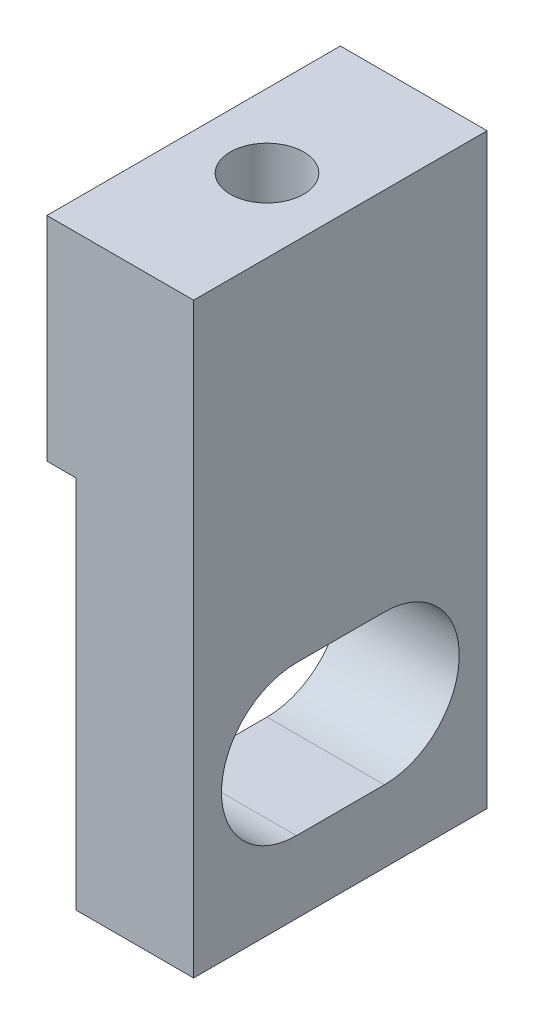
ISO-10303-21;
HEADER;
FILE_DESCRIPTION(('STEP AP214'),'2;1');
FILE_NAME('part.step','',(''),(''),'','','');
FILE_SCHEMA(('AUTOMOTIVE_DESIGN { 1 0 10303 214 1 1 1 1 }'));
ENDSEC;
DATA;
#1=APPLICATION_CONTEXT('core data for automotive mechanical design processes');
#2=APPLICATION_PROTOCOL_DEFINITION('international standard','automotive_design',2000,#1);
#3=PRODUCT_CONTEXT('',#1,'mechanical');
#4=PRODUCT('Part','Part','',(#3));
#5=PRODUCT_RELATED_PRODUCT_CATEGORY('part','',(#4));
#6=PRODUCT_DEFINITION_FORMATION('','',#4);
#7=PRODUCT_DEFINITION_CONTEXT('part definition',#1,'design');
#8=PRODUCT_DEFINITION('design','',#6,#7);
#9=PRODUCT_DEFINITION_SHAPE('','',#8);
#10=(LENGTH_UNIT() NAMED_UNIT(*) SI_UNIT(.MILLI.,.METRE.));
#11=(NAMED_UNIT(*) PLANE_ANGLE_UNIT() SI_UNIT($,.RADIAN.));
#12=(NAMED_UNIT(*) SI_UNIT($,.STERADIAN.) SOLID_ANGLE_UNIT());
#13=UNCERTAINTY_MEASURE_WITH_UNIT(LENGTH_MEASURE(1.E-05),#10,'distance_accuracy_value','');
#14=(GEOMETRIC_REPRESENTATION_CONTEXT(3) GLOBAL_UNCERTAINTY_ASSIGNED_CONTEXT((#13)) GLOBAL_UNIT_ASSIGNED_CONTEXT((#10,
#11,#12)) REPRESENTATION_CONTEXT('',''));
#15=CARTESIAN_POINT('',(0.,0.,0.));
#16=DIRECTION('',(0.,0.,1.));
#17=DIRECTION('',(1.,0.,0.));
#18=AXIS2_PLACEMENT_3D('',#15,#16,#17);
#19=CARTESIAN_POINT('',(0.,-14.5,10.));
#20=DIRECTION('',(1.00000000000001,0.,0.));
#21=DIRECTION('',(0.,0.,-1.00000000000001));
#22=AXIS2_PLACEMENT_3D('',#19,#20,#21);
#23=PLANE('',#22);
#24=DIRECTION('',(0.,-1.,0.));
#25=VECTOR('',#24,1.);
#26=CARTESIAN_POINT('',(0.,-14.5,-10.));
#27=LINE('',#26,#25);
#28=CARTESIAN_POINT('',(0.,0.,-10.));
#29=VERTEX_POINT('',#28);
#30=CARTESIAN_POINT('',(0.,-14.5,-10.));
#31=VERTEX_POINT('',#30);
#32=EDGE_CURVE('E177',#29,#31,#27,.T.);
#33=ORIENTED_EDGE('',*,*,#32,.T.);
#34=DIRECTION('',(0.,0.,-1.00000000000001));
#35=VECTOR('',#34,1.);
#36=CARTESIAN_POINT('',(0.,-14.5,10.));
#37=LINE('',#36,#35);
#38=CARTESIAN_POINT('',(0.,-14.5,10.));
#39=VERTEX_POINT('',#38);
#40=EDGE_CURVE('E11',#39,#31,#37,.T.);
#41=ORIENTED_EDGE('',*,*,#40,.F.);
#42=DIRECTION('',(0.,-1.,0.));
#43=VECTOR('',#42,1.);
#44=CARTESIAN_POINT('',(0.,-14.5,10.));
#45=LINE('',#44,#43);
#46=CARTESIAN_POINT('',(0.,0.,10.));
#47=VERTEX_POINT('',#46);
#48=EDGE_CURVE('E196',#47,#39,#45,.T.);
#49=ORIENTED_EDGE('',*,*,#48,.F.);
#50=DIRECTION('',(0.,0.,-1.00000000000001));
#51=VECTOR('',#50,1.);
#52=CARTESIAN_POINT('',(0.,0.,10.));
#53=LINE('',#52,#51);
#54=EDGE_CURVE('E215',#47,#29,#53,.T.);
#55=ORIENTED_EDGE('',*,*,#54,.T.);
#56=EDGE_LOOP('',(#33,#41,#49,#55));
#57=FACE_BOUND('',#56,.T.);
#58=ADVANCED_FACE('F42',(#57),#23,.F.);
#59=CARTESIAN_POINT('',(2.,-14.5,10.));
#60=DIRECTION('',(0.,1.,0.));
#61=DIRECTION('',(0.,0.,1.00000000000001));
#62=AXIS2_PLACEMENT_3D('',#59,#60,#61);
#63=PLANE('',#62);
#64=DIRECTION('',(1.00000000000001,0.,0.));
#65=VECTOR('',#64,1.);
#66=CARTESIAN_POINT('',(2.00000000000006,-14.5,-10.));
#67=LINE('',#66,#65);
#68=CARTESIAN_POINT('',(2.00000000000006,-14.5,-10.));
#69=VERTEX_POINT('',#68);
#70=EDGE_CURVE('E181',#31,#69,#67,.T.);
#71=ORIENTED_EDGE('',*,*,#70,.T.);
#72=DIRECTION('',(0.,0.,-1.00000000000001));
#73=VECTOR('',#72,1.);
#74=CARTESIAN_POINT('',(2.,-14.5,10.));
#75=LINE('',#74,#73);
#76=CARTESIAN_POINT('',(2.,-14.5,10.));
#77=VERTEX_POINT('',#76);
#78=EDGE_CURVE('E50',#77,#69,#75,.T.);
#79=ORIENTED_EDGE('',*,*,#78,.F.);
#80=DIRECTION('',(1.00000000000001,0.,0.));
#81=VECTOR('',#80,1.);
#82=CARTESIAN_POINT('',(2.,-14.5,10.));
#83=LINE('',#82,#81);
#84=EDGE_CURVE('E200',#39,#77,#83,.T.);
#85=ORIENTED_EDGE('',*,*,#84,.F.);
#86=ORIENTED_EDGE('',*,*,#40,.T.);
#87=EDGE_LOOP('',(#71,#79,#85,#86));
#88=FACE_BOUND('',#87,.T.);
#89=ADVANCED_FACE('F258',(#88),#63,.F.);
#90=CARTESIAN_POINT('',(2.00000000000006,-40.,10.000000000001));
#91=DIRECTION('',(1.00000000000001,0.,0.));
#92=DIRECTION('',(0.,0.,-1.00000000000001));
#93=AXIS2_PLACEMENT_3D('',#90,#91,#92);
#94=PLANE('',#93);
#95=DIRECTION('',(0.,0.,1.00000000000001));
#96=VECTOR('',#95,1.);
#97=CARTESIAN_POINT('',(2.00000000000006,-35.1,3.00000000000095));
#98=LINE('',#97,#96);
#99=CARTESIAN_POINT('',(2.00000000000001,-35.1,-2.99999999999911));
#100=VERTEX_POINT('',#99);
#101=CARTESIAN_POINT('',(2.00000000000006,-35.1,3.00000000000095));
#102=VERTEX_POINT('',#101);
#103=EDGE_CURVE('E140',#100,#102,#98,.T.);
#104=ORIENTED_EDGE('',*,*,#103,.F.);
#105=CARTESIAN_POINT('',(2.00000000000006,-30.,-3.));
#106=DIRECTION('',(1.00000000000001,0.,0.));
#107=DIRECTION('',(0.,0.,-1.00000000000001));
#108=AXIS2_PLACEMENT_3D('',#105,#106,#107);
#109=CIRCLE('',#108,5.1);
#110=CARTESIAN_POINT('',(2.00000000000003,-24.9,-3.00000000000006));
#111=VERTEX_POINT('',#110);
#112=EDGE_CURVE('E144',#111,#100,#109,.F.);
#113=ORIENTED_EDGE('',*,*,#112,.F.);
#114=DIRECTION('',(0.,0.,-1.00000000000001));
#115=VECTOR('',#114,1.);
#116=CARTESIAN_POINT('',(2.00000000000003,-24.9,-3.00000000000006));
#117=LINE('',#116,#115);
#118=CARTESIAN_POINT('',(2.00000000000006,-24.9,3.));
#119=VERTEX_POINT('',#118);
#120=EDGE_CURVE('E166',#119,#111,#117,.T.);
#121=ORIENTED_EDGE('',*,*,#120,.F.);
#122=CARTESIAN_POINT('',(2.00000000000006,-30.,3.));
#123=DIRECTION('',(1.00000000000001,0.,0.));
#124=DIRECTION('',(0.,0.,-1.00000000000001));
#125=AXIS2_PLACEMENT_3D('',#122,#123,#124);
#126=CIRCLE('',#125,5.1);
#127=EDGE_CURVE('E57',#102,#119,#126,.F.);
#128=ORIENTED_EDGE('',*,*,#127,.F.);
#129=EDGE_LOOP('',(#104,#113,#121,#128));
#130=FACE_BOUND('',#129,.T.);
#131=DIRECTION('',(0.,-1.,0.));
#132=VECTOR('',#131,1.);
#133=CARTESIAN_POINT('',(2.00000000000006,-40.,-9.99999999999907));
#134=LINE('',#133,#132);
#135=CARTESIAN_POINT('',(2.00000000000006,-40.,-9.99999999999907));
#136=VERTEX_POINT('',#135);
#137=EDGE_CURVE('E184',#69,#136,#134,.T.);
#138=ORIENTED_EDGE('',*,*,#137,.T.);
#139=DIRECTION('',(0.,0.,-1.00000000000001));
#140=VECTOR('',#139,1.);
#141=CARTESIAN_POINT('',(2.00000000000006,-40.,10.000000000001));
#142=LINE('',#141,#140);
#143=CARTESIAN_POINT('',(2.00000000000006,-40.,10.000000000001));
#144=VERTEX_POINT('',#143);
#145=EDGE_CURVE('E226',#144,#136,#142,.T.);
#146=ORIENTED_EDGE('',*,*,#145,.F.);
#147=DIRECTION('',(0.,-1.,0.));
#148=VECTOR('',#147,1.);
#149=CARTESIAN_POINT('',(2.00000000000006,-40.,10.000000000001));
#150=LINE('',#149,#148);
#151=EDGE_CURVE('E203',#77,#144,#150,.T.);
#152=ORIENTED_EDGE('',*,*,#151,.F.);
#153=ORIENTED_EDGE('',*,*,#78,.T.);
#154=EDGE_LOOP('',(#138,#146,#152,#153));
#155=FACE_BOUND('',#154,.T.);
#156=ADVANCED_FACE('F235',(#130,#155),#94,.F.);
#157=CARTESIAN_POINT('',(10.0000000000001,-39.9999999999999,10.000000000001));
#158=DIRECTION('',(0.,1.,0.));
#159=DIRECTION('',(0.,0.,1.00000000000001));
#160=AXIS2_PLACEMENT_3D('',#157,#158,#159);
#161=PLANE('',#160);
#162=DIRECTION('',(1.00000000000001,0.,0.));
#163=VECTOR('',#162,1.);
#164=CARTESIAN_POINT('',(10.0000000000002,-39.9999999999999,-9.99999999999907));
#165=LINE('',#164,#163);
#166=CARTESIAN_POINT('',(10.0000000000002,-39.9999999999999,-9.99999999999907));
#167=VERTEX_POINT('',#166);
#168=EDGE_CURVE('E187',#136,#167,#165,.T.);
#169=ORIENTED_EDGE('',*,*,#168,.T.);
#170=DIRECTION('',(0.,0.,-1.00000000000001));
#171=VECTOR('',#170,1.);
#172=CARTESIAN_POINT('',(10.0000000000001,-39.9999999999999,10.000000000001));
#173=LINE('',#172,#171);
#174=CARTESIAN_POINT('',(10.0000000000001,-39.9999999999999,10.000000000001));
#175=VERTEX_POINT('',#174);
#176=EDGE_CURVE('E222',#175,#167,#173,.T.);
#177=ORIENTED_EDGE('',*,*,#176,.F.);
#178=DIRECTION('',(1.00000000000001,0.,0.));
#179=VECTOR('',#178,1.);
#180=CARTESIAN_POINT('',(10.0000000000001,-39.9999999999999,10.000000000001));
#181=LINE('',#180,#179);
#182=EDGE_CURVE('E206',#144,#175,#181,.T.);
#183=ORIENTED_EDGE('',*,*,#182,.F.);
#184=ORIENTED_EDGE('',*,*,#145,.T.);
#185=EDGE_LOOP('',(#169,#177,#183,#184));
#186=FACE_BOUND('',#185,.T.);
#187=ADVANCED_FACE('F246',(#186),#161,.F.);
#188=CARTESIAN_POINT('',(10.0000000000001,0.,10.));
#189=DIRECTION('',(-1.00000000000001,0.,0.));
#190=DIRECTION('',(0.,-1.,0.));
#191=AXIS2_PLACEMENT_3D('',#188,#189,#190);
#192=PLANE('',#191);
#193=DIRECTION('',(0.,0.,1.00000000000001));
#194=VECTOR('',#193,1.);
#195=CARTESIAN_POINT('',(9.9999999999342,-24.8999999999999,-3.00000000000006));
#196=LINE('',#195,#194);
#197=CARTESIAN_POINT('',(10.0000000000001,-24.8999999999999,-3.00000000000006));
#198=VERTEX_POINT('',#197);
#199=CARTESIAN_POINT('',(9.99999999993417,-24.8999999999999,3.));
#200=VERTEX_POINT('',#199);
#201=EDGE_CURVE('E150',#198,#200,#196,.T.);
#202=ORIENTED_EDGE('',*,*,#201,.F.);
#203=CARTESIAN_POINT('',(9.99999999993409,-29.9999999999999,-2.99999999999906));
#204=DIRECTION('',(1.00000000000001,0.,0.));
#205=DIRECTION('',(0.,1.,0.));
#206=AXIS2_PLACEMENT_3D('',#203,#204,#205);
#207=CIRCLE('',#206,5.1);
#208=CARTESIAN_POINT('',(9.99999999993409,-35.0999999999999,-2.99999999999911));
#209=VERTEX_POINT('',#208);
#210=EDGE_CURVE('E65',#209,#198,#207,.T.);
#211=ORIENTED_EDGE('',*,*,#210,.F.);
#212=DIRECTION('',(0.,0.,-1.00000000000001));
#213=VECTOR('',#212,1.);
#214=CARTESIAN_POINT('',(9.99999999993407,-35.0999999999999,3.00000000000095));
#215=LINE('',#214,#213);
#216=CARTESIAN_POINT('',(9.99999999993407,-35.0999999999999,3.00000000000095));
#217=VERTEX_POINT('',#216);
#218=EDGE_CURVE('E158',#217,#209,#215,.T.);
#219=ORIENTED_EDGE('',*,*,#218,.F.);
#220=CARTESIAN_POINT('',(9.99999999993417,-29.9999999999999,3.00000000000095));
#221=DIRECTION('',(1.00000000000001,0.,0.));
#222=DIRECTION('',(0.,1.,0.));
#223=AXIS2_PLACEMENT_3D('',#220,#221,#222);
#224=CIRCLE('',#223,5.1);
#225=EDGE_CURVE('E154',#200,#217,#224,.T.);
#226=ORIENTED_EDGE('',*,*,#225,.F.);
#227=EDGE_LOOP('',(#202,#211,#219,#226));
#228=FACE_BOUND('',#227,.T.);
#229=DIRECTION('',(0.,1.,0.));
#230=VECTOR('',#229,1.);
#231=CARTESIAN_POINT('',(10.0000000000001,0.,-10.));
#232=LINE('',#231,#230);
#233=CARTESIAN_POINT('',(10.0000000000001,0.,-10.));
#234=VERTEX_POINT('',#233);
#235=EDGE_CURVE('E190',#167,#234,#232,.T.);
#236=ORIENTED_EDGE('',*,*,#235,.T.);
#237=DIRECTION('',(0.,0.,-1.00000000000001));
#238=VECTOR('',#237,1.);
#239=CARTESIAN_POINT('',(10.0000000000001,0.,10.));
#240=LINE('',#239,#238);
#241=CARTESIAN_POINT('',(10.0000000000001,0.,10.));
#242=VERTEX_POINT('',#241);
#243=EDGE_CURVE('E219',#242,#234,#240,.T.);
#244=ORIENTED_EDGE('',*,*,#243,.F.);
#245=DIRECTION('',(0.,1.,0.));
#246=VECTOR('',#245,1.);
#247=CARTESIAN_POINT('',(10.0000000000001,0.,10.));
#248=LINE('',#247,#246);
#249=EDGE_CURVE('E209',#175,#242,#248,.T.);
#250=ORIENTED_EDGE('',*,*,#249,.F.);
#251=ORIENTED_EDGE('',*,*,#176,.T.);
#252=EDGE_LOOP('',(#236,#244,#250,#251));
#253=FACE_BOUND('',#252,.T.);
#254=ADVANCED_FACE('F250',(#228,#253),#192,.F.);
#255=CARTESIAN_POINT('',(0.,0.,10.));
#256=DIRECTION('',(0.,-1.,0.));
#257=DIRECTION('',(0.,0.,-1.00000000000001));
#258=AXIS2_PLACEMENT_3D('',#255,#256,#257);
#259=PLANE('',#258);
#260=CARTESIAN_POINT('',(5.00000000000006,0.,0.));
#261=DIRECTION('',(0.,1.,0.));
#262=DIRECTION('',(0.,0.,1.00000000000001));
#263=AXIS2_PLACEMENT_3D('',#260,#261,#262);
#264=CIRCLE('',#263,2.49999999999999);
#265=CARTESIAN_POINT('',(5.00000000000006,0.,2.50000000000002));
#266=VERTEX_POINT('',#265);
#267=EDGE_CURVE('E130',#266,#266,#264,.T.);
#268=ORIENTED_EDGE('',*,*,#267,.F.);
#269=EDGE_LOOP('',(#268));
#270=FACE_BOUND('',#269,.T.);
#271=DIRECTION('',(-1.00000000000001,0.,0.));
#272=VECTOR('',#271,1.);
#273=CARTESIAN_POINT('',(0.,0.,-10.));
#274=LINE('',#273,#272);
#275=EDGE_CURVE('E193',#234,#29,#274,.T.);
#276=ORIENTED_EDGE('',*,*,#275,.T.);
#277=ORIENTED_EDGE('',*,*,#54,.F.);
#278=DIRECTION('',(-1.00000000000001,0.,0.));
#279=VECTOR('',#278,1.);
#280=CARTESIAN_POINT('',(0.,0.,10.));
#281=LINE('',#280,#279);
#282=EDGE_CURVE('E212',#242,#47,#281,.T.);
#283=ORIENTED_EDGE('',*,*,#282,.F.);
#284=ORIENTED_EDGE('',*,*,#243,.T.);
#285=EDGE_LOOP('',(#276,#277,#283,#284));
#286=FACE_BOUND('',#285,.T.);
#287=ADVANCED_FACE('F261',(#270,#286),#259,.F.);
#288=CARTESIAN_POINT('',(0.,0.,10.));
#289=DIRECTION('',(0.,0.,-1.00000000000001));
#290=DIRECTION('',(-1.00000000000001,0.,0.));
#291=AXIS2_PLACEMENT_3D('',#288,#289,#290);
#292=PLANE('',#291);
#293=ORIENTED_EDGE('',*,*,#48,.T.);
#294=ORIENTED_EDGE('',*,*,#84,.T.);
#295=ORIENTED_EDGE('',*,*,#151,.T.);
#296=ORIENTED_EDGE('',*,*,#182,.T.);
#297=ORIENTED_EDGE('',*,*,#249,.T.);
#298=ORIENTED_EDGE('',*,*,#282,.T.);
#299=EDGE_LOOP('',(#293,#294,#295,#296,#297,#298));
#300=FACE_BOUND('',#299,.T.);
#301=ADVANCED_FACE('F254',(#300),#292,.F.);
#302=CARTESIAN_POINT('',(0.,0.,-10.));
#303=DIRECTION('',(0.,0.,-1.00000000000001));
#304=DIRECTION('',(-1.00000000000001,0.,0.));
#305=AXIS2_PLACEMENT_3D('',#302,#303,#304);
#306=PLANE('',#305);
#307=ORIENTED_EDGE('',*,*,#32,.F.);
#308=ORIENTED_EDGE('',*,*,#275,.F.);
#309=ORIENTED_EDGE('',*,*,#235,.F.);
#310=ORIENTED_EDGE('',*,*,#168,.F.);
#311=ORIENTED_EDGE('',*,*,#137,.F.);
#312=ORIENTED_EDGE('',*,*,#70,.F.);
#313=EDGE_LOOP('',(#307,#308,#309,#310,#311,#312));
#314=FACE_BOUND('',#313,.T.);
#315=ADVANCED_FACE('F241',(#314),#306,.T.);
#316=CARTESIAN_POINT('',(-0.00099999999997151,-30.,-3.));
#317=DIRECTION('',(1.00000000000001,0.,0.));
#318=DIRECTION('',(0.,1.,0.));
#319=AXIS2_PLACEMENT_3D('',#316,#317,#318);
#320=CYLINDRICAL_SURFACE('',#319,5.1);
#321=ORIENTED_EDGE('',*,*,#112,.T.);
#322=DIRECTION('',(1.00000000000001,0.,0.));
#323=VECTOR('',#322,1.);
#324=CARTESIAN_POINT('',(-0.00100000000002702,-35.1,-2.99999999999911));
#325=LINE('',#324,#323);
#326=EDGE_CURVE('E163',#100,#209,#325,.T.);
#327=ORIENTED_EDGE('',*,*,#326,.T.);
#328=ORIENTED_EDGE('',*,*,#210,.T.);
#329=DIRECTION('',(1.00000000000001,0.,0.));
#330=VECTOR('',#329,1.);
#331=CARTESIAN_POINT('',(-0.00100000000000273,-24.9,-3.00000000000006));
#332=LINE('',#331,#330);
#333=EDGE_CURVE('E162',#111,#198,#332,.T.);
#334=ORIENTED_EDGE('',*,*,#333,.F.);
#335=EDGE_LOOP('',(#321,#327,#328,#334));
#336=FACE_BOUND('',#335,.T.);
#337=ADVANCED_FACE('F308',(#336),#320,.F.);
#338=CARTESIAN_POINT('',(-0.001000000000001,-35.1,3.00000000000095));
#339=DIRECTION('',(0.,-1.,0.));
#340=DIRECTION('',(1.00000000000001,0.,0.));
#341=AXIS2_PLACEMENT_3D('',#338,#339,#340);
#342=PLANE('',#341);
#343=ORIENTED_EDGE('',*,*,#103,.T.);
#344=DIRECTION('',(1.00000000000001,0.,0.));
#345=VECTOR('',#344,1.);
#346=CARTESIAN_POINT('',(-0.001000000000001,-35.1,3.00000000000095));
#347=LINE('',#346,#345);
#348=EDGE_CURVE('E167',#102,#217,#347,.T.);
#349=ORIENTED_EDGE('',*,*,#348,.T.);
#350=ORIENTED_EDGE('',*,*,#218,.T.);
#351=ORIENTED_EDGE('',*,*,#326,.F.);
#352=EDGE_LOOP('',(#343,#349,#350,#351));
#353=FACE_BOUND('',#352,.T.);
#354=ADVANCED_FACE('F316',(#353),#342,.F.);
#355=CARTESIAN_POINT('',(-0.001000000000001,-30.,3.));
#356=DIRECTION('',(1.00000000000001,0.,0.));
#357=DIRECTION('',(0.,1.,0.));
#358=AXIS2_PLACEMENT_3D('',#355,#356,#357);
#359=CYLINDRICAL_SURFACE('',#358,5.1);
#360=ORIENTED_EDGE('',*,*,#127,.T.);
#361=DIRECTION('',(1.00000000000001,0.,0.));
#362=VECTOR('',#361,1.);
#363=CARTESIAN_POINT('',(-0.00100000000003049,-24.9,3.));
#364=LINE('',#363,#362);
#365=EDGE_CURVE('E170',#119,#200,#364,.T.);
#366=ORIENTED_EDGE('',*,*,#365,.T.);
#367=ORIENTED_EDGE('',*,*,#225,.T.);
#368=ORIENTED_EDGE('',*,*,#348,.F.);
#369=EDGE_LOOP('',(#360,#366,#367,#368));
#370=FACE_BOUND('',#369,.T.);
#371=ADVANCED_FACE('F324',(#370),#359,.F.);
#372=CARTESIAN_POINT('',(-0.00100000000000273,-24.9,-3.00000000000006));
#373=DIRECTION('',(0.,1.,0.));
#374=DIRECTION('',(-1.00000000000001,0.,0.));
#375=AXIS2_PLACEMENT_3D('',#372,#373,#374);
#376=PLANE('',#375);
#377=ORIENTED_EDGE('',*,*,#120,.T.);
#378=ORIENTED_EDGE('',*,*,#333,.T.);
#379=ORIENTED_EDGE('',*,*,#201,.T.);
#380=ORIENTED_EDGE('',*,*,#365,.F.);
#381=EDGE_LOOP('',(#377,#378,#379,#380));
#382=FACE_BOUND('',#381,.T.);
#383=ADVANCED_FACE('F333',(#382),#376,.F.);
#384=CARTESIAN_POINT('',(5.00000000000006,0.,0.));
#385=DIRECTION('',(0.,1.,0.));
#386=DIRECTION('',(0.,0.,1.00000000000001));
#387=AXIS2_PLACEMENT_3D('',#384,#385,#386);
#388=CYLINDRICAL_SURFACE('',#387,2.49999999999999);
#389=CARTESIAN_POINT('',(5.00000000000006,-16.,0.));
#390=DIRECTION('',(0.,1.,0.));
#391=DIRECTION('',(0.,0.,1.00000000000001));
#392=AXIS2_PLACEMENT_3D('',#389,#390,#391);
#393=CIRCLE('',#392,2.49999999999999);
#394=CARTESIAN_POINT('',(5.00000000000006,-16.,2.50000000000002));
#395=VERTEX_POINT('',#394);
#396=EDGE_CURVE('E127',#395,#395,#393,.T.);
#397=ORIENTED_EDGE('',*,*,#396,.F.);
#398=EDGE_LOOP('',(#397));
#399=FACE_BOUND('',#398,.T.);
#400=ORIENTED_EDGE('',*,*,#267,.T.);
#401=EDGE_LOOP('',(#400));
#402=FACE_BOUND('',#401,.T.);
#403=ADVANCED_FACE('F123',(#399,#402),#388,.F.);
#404=CARTESIAN_POINT('',(5.00000000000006,-16.,0.));
#405=DIRECTION('',(0.,1.,0.));
#406=DIRECTION('',(0.,0.,1.00000000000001));
#407=AXIS2_PLACEMENT_3D('',#404,#405,#406);
#408=CONICAL_SURFACE('',#407,2.49999999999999,1.02974425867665);
#409=CARTESIAN_POINT('',(5.00000000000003,-17.5021515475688,0.));
#410=VERTEX_POINT('',#409);
#411=VERTEX_LOOP('',#410);
#412=FACE_BOUND('',#411,.T.);
#413=ORIENTED_EDGE('',*,*,#396,.T.);
#414=EDGE_LOOP('',(#413));
#415=FACE_BOUND('',#414,.T.);
#416=ADVANCED_FACE('F120',(#412,#415),#408,.F.);
#417=CLOSED_SHELL('',(#58,#89,#156,#187,#254,#287,#301,#315,#337,#354,#371,#383,#403,#416));
#418=MANIFOLD_SOLID_BREP('B2',#417);
#419=ADVANCED_BREP_SHAPE_REPRESENTATION('',(#18,#418),#14);
#420=SHAPE_DEFINITION_REPRESENTATION(#9,#419);
ENDSEC;
END-ISO-10303-21;
